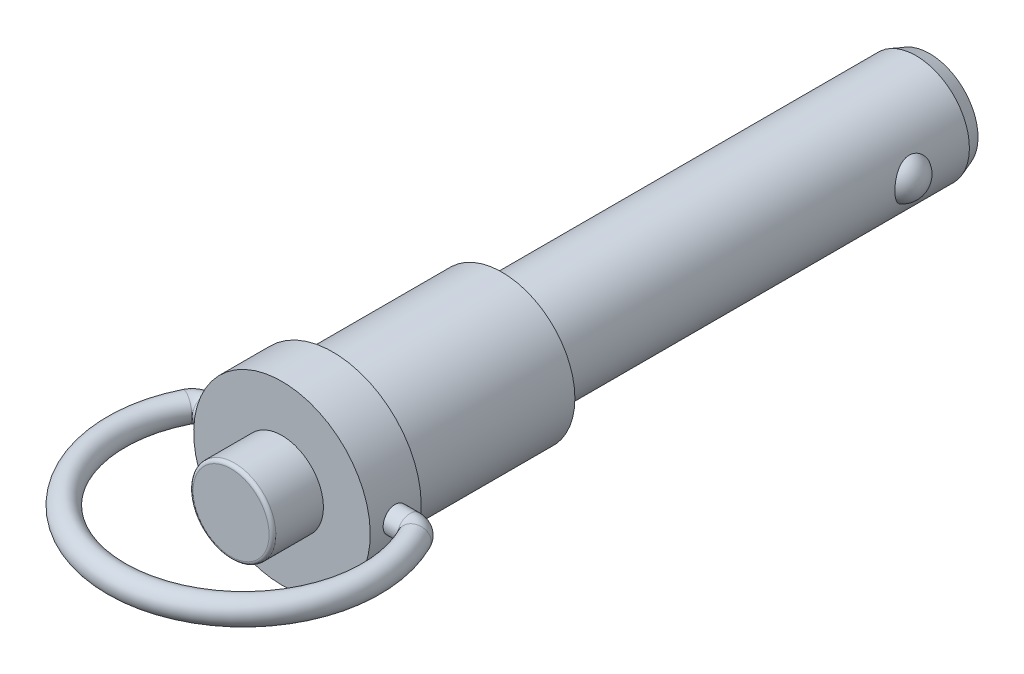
ISO-10303-21;
HEADER;
FILE_DESCRIPTION(('STEP AP214'),'2;1');
FILE_NAME('part.step','',(''),(''),'','','');
FILE_SCHEMA(('AUTOMOTIVE_DESIGN { 1 0 10303 214 1 1 1 1 }'));
ENDSEC;
DATA;
#1=APPLICATION_CONTEXT('core data for automotive mechanical design processes');
#2=APPLICATION_PROTOCOL_DEFINITION('international standard','automotive_design',2000,#1);
#3=PRODUCT_CONTEXT('',#1,'mechanical');
#4=PRODUCT('Part','Part','',(#3));
#5=PRODUCT_RELATED_PRODUCT_CATEGORY('part','',(#4));
#6=PRODUCT_DEFINITION_FORMATION('','',#4);
#7=PRODUCT_DEFINITION_CONTEXT('part definition',#1,'design');
#8=PRODUCT_DEFINITION('design','',#6,#7);
#9=PRODUCT_DEFINITION_SHAPE('','',#8);
#10=(LENGTH_UNIT() NAMED_UNIT(*) SI_UNIT(.MILLI.,.METRE.));
#11=(NAMED_UNIT(*) PLANE_ANGLE_UNIT() SI_UNIT($,.RADIAN.));
#12=(NAMED_UNIT(*) SI_UNIT($,.STERADIAN.) SOLID_ANGLE_UNIT());
#13=UNCERTAINTY_MEASURE_WITH_UNIT(LENGTH_MEASURE(1.E-05),#10,'distance_accuracy_value','');
#14=(GEOMETRIC_REPRESENTATION_CONTEXT(3) GLOBAL_UNCERTAINTY_ASSIGNED_CONTEXT((#13)) GLOBAL_UNIT_ASSIGNED_CONTEXT((#10,
#11,#12)) REPRESENTATION_CONTEXT('',''));
#15=CARTESIAN_POINT('',(0.,0.,0.));
#16=DIRECTION('',(0.,0.,1.));
#17=DIRECTION('',(1.,0.,0.));
#18=AXIS2_PLACEMENT_3D('',#15,#16,#17);
#19=CARTESIAN_POINT('',(-7.23283748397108,0.,-63.9826));
#20=DIRECTION('',(0.,0.,1.));
#21=DIRECTION('',(0.,1.,0.));
#22=AXIS2_PLACEMENT_3D('',#19,#20,#21);
#23=PLANE('',#22);
#24=CARTESIAN_POINT('',(0.,0.,-63.9826));
#25=DIRECTION('',(0.,0.,1.));
#26=DIRECTION('',(0.,1.,0.));
#27=AXIS2_PLACEMENT_3D('',#24,#25,#26);
#28=CIRCLE('',#27,7.23283748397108);
#29=CARTESIAN_POINT('',(0.,7.23283748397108,-63.9826));
#30=VERTEX_POINT('',#29);
#31=EDGE_CURVE('E249',#30,#30,#28,.T.);
#32=ORIENTED_EDGE('',*,*,#31,.F.);
#33=EDGE_LOOP('',(#32));
#34=FACE_BOUND('',#33,.T.);
#35=ADVANCED_FACE('F14',(#34),#23,.F.);
#36=CARTESIAN_POINT('',(6.3254,0.,-53.5178));
#37=DIRECTION('',(0.,0.,1.));
#38=DIRECTION('',(-1.,0.,0.));
#39=AXIS2_PLACEMENT_3D('',#36,#37,#38);
#40=SPHERICAL_SURFACE('',#39,3.175);
#41=CARTESIAN_POINT('',(7.972425,0.,-50.8034062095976));
#42=CARTESIAN_POINT('',(7.97241726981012,0.174963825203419,-50.8034110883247));
#43=CARTESIAN_POINT('',(7.96661031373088,0.3500722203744,-50.8168531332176));
#44=CARTESIAN_POINT('',(7.94391651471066,0.695574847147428,-50.8705412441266));
#45=CARTESIAN_POINT('',(7.92701418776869,0.865962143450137,-50.9108247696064));
#46=CARTESIAN_POINT('',(7.88381094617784,1.19705751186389,-51.0178494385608));
#47=CARTESIAN_POINT('',(7.85750751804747,1.35776298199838,-51.084597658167));
#48=CARTESIAN_POINT('',(7.79828591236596,1.66454963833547,-51.2437588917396));
#49=CARTESIAN_POINT('',(7.76536929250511,1.81063425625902,-51.336165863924));
#50=CARTESIAN_POINT('',(7.6973220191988,2.08082133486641,-51.5434318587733));
#51=CARTESIAN_POINT('',(7.6622476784,2.20529978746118,-51.6578132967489));
#52=CARTESIAN_POINT('',(7.61082801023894,2.37452550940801,-51.8452714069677));
#53=CARTESIAN_POINT('',(7.59387880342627,2.42804053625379,-51.9104406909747));
#54=CARTESIAN_POINT('',(7.56094914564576,2.52871559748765,-52.045725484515));
#55=CARTESIAN_POINT('',(7.54496815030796,2.57587922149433,-52.115838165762));
#56=CARTESIAN_POINT('',(7.51569590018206,2.66002101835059,-52.2550958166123));
#57=CARTESIAN_POINT('',(7.50229271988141,2.69749875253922,-52.3239160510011));
#58=CARTESIAN_POINT('',(7.47725403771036,2.76614659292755,-52.4649044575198));
#59=CARTESIAN_POINT('',(7.46561758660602,2.79732008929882,-52.537070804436));
#60=CARTESIAN_POINT('',(7.44451748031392,2.85299970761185,-52.6841997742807));
#61=CARTESIAN_POINT('',(7.43505273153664,2.87750918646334,-52.7591609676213));
#62=CARTESIAN_POINT('',(7.41863811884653,2.919568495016,-52.9112788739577));
#63=CARTESIAN_POINT('',(7.41168797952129,2.93711908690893,-52.9884353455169));
#64=CARTESIAN_POINT('',(7.40116212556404,2.96353478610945,-53.1359046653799));
#65=CARTESIAN_POINT('',(7.39730521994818,2.97312751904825,-53.2060679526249));
#66=CARTESIAN_POINT('',(7.39192783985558,2.98647205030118,-53.3470623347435));
#67=CARTESIAN_POINT('',(7.3904081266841,2.99022194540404,-53.4178936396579));
#68=CARTESIAN_POINT('',(7.38975833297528,2.99182794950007,-53.5595897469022));
#69=CARTESIAN_POINT('',(7.39062662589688,2.98968807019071,-53.6304544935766));
#70=CARTESIAN_POINT('',(7.39471686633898,2.97955470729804,-53.7717034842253));
#71=CARTESIAN_POINT('',(7.39793967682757,2.97155907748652,-53.8420875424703));
#72=CARTESIAN_POINT('',(7.41052697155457,2.94009947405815,-54.0439191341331));
#73=CARTESIAN_POINT('',(7.42280379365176,2.90920494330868,-54.1741115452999));
#74=CARTESIAN_POINT('',(7.45413145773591,2.82795803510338,-54.4273054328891));
#75=CARTESIAN_POINT('',(7.47318306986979,2.77760344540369,-54.5503060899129));
#76=CARTESIAN_POINT('',(7.51696016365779,2.65690222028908,-54.7909708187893));
#77=CARTESIAN_POINT('',(7.5418730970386,2.58587106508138,-54.9082567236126));
#78=CARTESIAN_POINT('',(7.59450635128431,2.426938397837,-55.1300314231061));
#79=CARTESIAN_POINT('',(7.62222751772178,2.33903179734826,-55.234516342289));
#80=CARTESIAN_POINT('',(7.68069620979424,2.13967899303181,-55.4383986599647));
#81=CARTESIAN_POINT('',(7.71148158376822,2.02679150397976,-55.5363756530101));
#82=CARTESIAN_POINT('',(7.77061509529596,1.78672707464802,-55.7138815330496));
#83=CARTESIAN_POINT('',(7.79896157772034,1.65954056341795,-55.7933979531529));
#84=CARTESIAN_POINT('',(7.85313577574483,1.38188004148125,-55.939506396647));
#85=CARTESIAN_POINT('',(7.87849512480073,1.23034006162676,-56.0042480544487));
#86=CARTESIAN_POINT('',(7.92093083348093,0.918236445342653,-56.1099613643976));
#87=CARTESIAN_POINT('',(7.9380155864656,0.757682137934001,-56.1509571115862));
#88=CARTESIAN_POINT('',(7.95754077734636,0.496793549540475,-56.1973352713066));
#89=CARTESIAN_POINT('',(7.96310427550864,0.397984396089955,-56.2104005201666));
#90=CARTESIAN_POINT('',(7.97054862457,0.199465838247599,-56.2278312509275));
#91=CARTESIAN_POINT('',(7.97242940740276,0.0997564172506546,-56.2321965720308));
#92=CARTESIAN_POINT('',(7.97241726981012,-0.174963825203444,-56.2321889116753));
#93=CARTESIAN_POINT('',(7.96661031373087,-0.350072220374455,-56.2187468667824));
#94=CARTESIAN_POINT('',(7.94391651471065,-0.695574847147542,-56.1650587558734));
#95=CARTESIAN_POINT('',(7.92701418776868,-0.865962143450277,-56.1247752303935));
#96=CARTESIAN_POINT('',(7.88381094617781,-1.19705751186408,-56.0177505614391));
#97=CARTESIAN_POINT('',(7.85750751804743,-1.3577629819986,-55.9510023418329));
#98=CARTESIAN_POINT('',(7.79828591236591,-1.66454963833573,-55.7918411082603));
#99=CARTESIAN_POINT('',(7.76536929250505,-1.8106342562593,-55.6994341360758));
#100=CARTESIAN_POINT('',(7.69732201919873,-2.08082133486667,-55.4921681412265));
#101=CARTESIAN_POINT('',(7.66224767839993,-2.20529978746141,-55.3777867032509));
#102=CARTESIAN_POINT('',(7.61082801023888,-2.37452550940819,-55.190328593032));
#103=CARTESIAN_POINT('',(7.59387880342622,-2.42804053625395,-55.125159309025));
#104=CARTESIAN_POINT('',(7.56094914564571,-2.52871559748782,-54.9898745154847));
#105=CARTESIAN_POINT('',(7.54496815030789,-2.57587922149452,-54.9197618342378));
#106=CARTESIAN_POINT('',(7.51569590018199,-2.66002101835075,-54.7805041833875));
#107=CARTESIAN_POINT('',(7.50229271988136,-2.69749875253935,-54.7116839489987));
#108=CARTESIAN_POINT('',(7.47725403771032,-2.76614659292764,-54.57069554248));
#109=CARTESIAN_POINT('',(7.46561758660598,-2.79732008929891,-54.4985291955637));
#110=CARTESIAN_POINT('',(7.44451748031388,-2.85299970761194,-54.351400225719));
#111=CARTESIAN_POINT('',(7.43505273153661,-2.87750918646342,-54.2764390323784));
#112=CARTESIAN_POINT('',(7.41863811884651,-2.91956849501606,-54.124321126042));
#113=CARTESIAN_POINT('',(7.41168797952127,-2.93711908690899,-54.0471646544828));
#114=CARTESIAN_POINT('',(7.40116212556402,-2.96353478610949,-53.8996953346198));
#115=CARTESIAN_POINT('',(7.39730521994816,-2.97312751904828,-53.8295320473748));
#116=CARTESIAN_POINT('',(7.39192783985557,-2.98647205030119,-53.6885376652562));
#117=CARTESIAN_POINT('',(7.3904081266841,-2.99022194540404,-53.6177063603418));
#118=CARTESIAN_POINT('',(7.38975833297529,-2.99182794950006,-53.4760102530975));
#119=CARTESIAN_POINT('',(7.39062662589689,-2.98968807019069,-53.4051455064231));
#120=CARTESIAN_POINT('',(7.39471686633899,-2.979554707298,-53.2638965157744));
#121=CARTESIAN_POINT('',(7.39793967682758,-2.97155907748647,-53.1935124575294));
#122=CARTESIAN_POINT('',(7.41052697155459,-2.94009947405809,-52.9916808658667));
#123=CARTESIAN_POINT('',(7.42280379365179,-2.90920494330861,-52.8614884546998));
#124=CARTESIAN_POINT('',(7.45413145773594,-2.82795803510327,-52.6082945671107));
#125=CARTESIAN_POINT('',(7.47318306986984,-2.77760344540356,-52.4852939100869));
#126=CARTESIAN_POINT('',(7.51696016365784,-2.65690222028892,-52.2446291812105));
#127=CARTESIAN_POINT('',(7.54187309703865,-2.58587106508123,-52.1273432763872));
#128=CARTESIAN_POINT('',(7.59450635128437,-2.42693839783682,-51.9055685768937));
#129=CARTESIAN_POINT('',(7.62222751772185,-2.33903179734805,-51.8010836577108));
#130=CARTESIAN_POINT('',(7.68069620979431,-2.13967899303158,-51.5972013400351));
#131=CARTESIAN_POINT('',(7.71148158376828,-2.02679150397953,-51.4992243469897));
#132=CARTESIAN_POINT('',(7.77061509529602,-1.78672707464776,-51.3217184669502));
#133=CARTESIAN_POINT('',(7.7989615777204,-1.65954056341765,-51.242202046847));
#134=CARTESIAN_POINT('',(7.85313577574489,-1.38188004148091,-51.0960936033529));
#135=CARTESIAN_POINT('',(7.87849512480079,-1.23034006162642,-51.0313519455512));
#136=CARTESIAN_POINT('',(7.92093083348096,-0.918236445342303,-50.9256386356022));
#137=CARTESIAN_POINT('',(7.93801558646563,-0.757682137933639,-50.8846428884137));
#138=CARTESIAN_POINT('',(7.95754077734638,-0.496793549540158,-50.8382647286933));
#139=CARTESIAN_POINT('',(7.96310427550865,-0.397984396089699,-50.8251994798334));
#140=CARTESIAN_POINT('',(7.97054862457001,-0.199465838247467,-50.8077687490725));
#141=CARTESIAN_POINT('',(7.97242940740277,-0.0997564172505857,-50.8034034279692));
#142=CARTESIAN_POINT('',(7.972425,0.,-50.8034062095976));
#143=B_SPLINE_CURVE_WITH_KNOTS('',3,(#41,#42,#43,#44,#45,#46,#47,#48,#49,#50,#51,#52,#53,#54,
#55,#56,#57,#58,#59,#60,#61,#62,#63,#64,#65,#66,#67,#68,#69,#70,#71,#72,#73,#74,#75,#76,#77,#78,
#79,#80,#81,#82,#83,#84,#85,#86,#87,#88,#89,#90,#91,#92,#93,#94,#95,#96,#97,#98,#99,#100,#101,
#102,#103,#104,#105,#106,#107,#108,#109,#110,#111,#112,#113,#114,#115,#116,#117,#118,#119,#120,
#121,#122,#123,#124,#125,#126,#127,#128,#129,#130,#131,#132,#133,#134,#135,#136,#137,#138,#139,
#140,#141,#142),.UNSPECIFIED.,.T.,.F.,(4,2,2,2,2,2,2,2,2,2,2,2,2,2,2,2,2,2,2,2,2,2,2,2,2,2,2,2,
2,2,2,2,2,2,2,2,2,2,2,2,2,2,2,2,2,2,2,2,2,2,4),(0.,0.524532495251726,1.04979855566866,
1.575205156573,2.10048814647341,2.61543479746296,2.87315909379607,3.13073711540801,
3.3689179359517,3.6069703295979,3.84490258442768,4.08280877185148,4.29529683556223,
4.50785409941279,4.7202666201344,4.93275703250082,5.33386765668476,5.73502389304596,
6.15136290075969,6.56782764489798,7.02375816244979,7.47999569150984,7.97801301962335,
8.47552411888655,8.77458316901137,9.07364774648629,9.59818024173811,10.1234463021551,
10.6488529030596,11.1741358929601,11.6890825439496,11.9468068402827,12.2043848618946,
12.4425656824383,12.6806180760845,12.9185503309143,13.1564565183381,13.3689445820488,
13.5815018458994,13.793914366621,14.0064047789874,14.4075154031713,14.8086716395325,
15.2250106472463,15.6414753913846,16.0974059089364,16.5536434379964,17.05166076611,
17.5491718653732,17.8482309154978,18.1472954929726),.UNSPECIFIED.);
#144=CARTESIAN_POINT('',(7.972425,0.,-50.8034062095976));
#145=VERTEX_POINT('',#144);
#146=EDGE_CURVE('E230',#145,#145,#143,.T.);
#147=ORIENTED_EDGE('',*,*,#146,.F.);
#148=EDGE_LOOP('',(#147));
#149=FACE_BOUND('',#148,.T.);
#150=ADVANCED_FACE('F203',(#149),#40,.T.);
#151=CARTESIAN_POINT('',(-6.3246,0.,-53.5178));
#152=DIRECTION('',(0.,0.,1.));
#153=DIRECTION('',(-1.,0.,0.));
#154=AXIS2_PLACEMENT_3D('',#151,#152,#153);
#155=SPHERICAL_SURFACE('',#154,3.175);
#156=CARTESIAN_POINT('',(-7.972425,0.,-56.2317082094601));
#157=CARTESIAN_POINT('',(-7.97241727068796,0.174952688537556,-56.2317033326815));
#158=CARTESIAN_POINT('',(-7.96661105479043,0.350049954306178,-56.2182623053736));
#159=CARTESIAN_POINT('',(-7.94392013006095,0.69553082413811,-56.1645780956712));
#160=CARTESIAN_POINT('',(-7.92701993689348,0.865907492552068,-56.1242974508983));
#161=CARTESIAN_POINT('',(-7.88382210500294,1.19698257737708,-56.0172798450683));
#162=CARTESIAN_POINT('',(-7.85752194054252,1.35767837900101,-55.950535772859));
#163=CARTESIAN_POINT('',(-7.79830777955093,1.66444625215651,-55.7913834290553));
#164=CARTESIAN_POINT('',(-7.76539534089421,1.81052175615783,-55.6989812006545));
#165=CARTESIAN_POINT('',(-7.69735815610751,2.08068673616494,-55.4917274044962));
#166=CARTESIAN_POINT('',(-7.66228978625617,2.20515274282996,-55.3773541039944));
#167=CARTESIAN_POINT('',(-7.61087967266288,2.37435974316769,-55.1899087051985));
#168=CARTESIAN_POINT('',(-7.593933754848,2.42786851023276,-55.124743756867));
#169=CARTESIAN_POINT('',(-7.5610108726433,2.52853087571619,-54.9894677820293));
#170=CARTESIAN_POINT('',(-7.54503336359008,2.57568806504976,-54.9193595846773));
#171=CARTESIAN_POINT('',(-7.515769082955,2.65981407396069,-54.7801158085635));
#172=CARTESIAN_POINT('',(-7.5023702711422,2.69728292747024,-54.7113052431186));
#173=CARTESIAN_POINT('',(-7.47734019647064,2.7659135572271,-54.5703368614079));
#174=CARTESIAN_POINT('',(-7.46570798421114,2.79707872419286,-54.4981808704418));
#175=CARTESIAN_POINT('',(-7.44461613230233,2.8527421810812,-54.3510733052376));
#176=CARTESIAN_POINT('',(-7.43515539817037,2.87724383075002,-54.2761231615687));
#177=CARTESIAN_POINT('',(-7.41874848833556,2.91928796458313,-54.1240280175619));
#178=CARTESIAN_POINT('',(-7.41180203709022,2.93683121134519,-54.0468832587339));
#179=CARTESIAN_POINT('',(-7.40128307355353,2.96323267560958,-53.8994411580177));
#180=CARTESIAN_POINT('',(-7.39742927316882,2.97281883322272,-53.829293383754));
#181=CARTESIAN_POINT('',(-7.3920573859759,2.98615137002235,-53.6883306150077));
#182=CARTESIAN_POINT('',(-7.39054006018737,2.98989584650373,-53.6175154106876));
#183=CARTESIAN_POINT('',(-7.38989424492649,2.99149222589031,-53.4758519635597));
#184=CARTESIAN_POINT('',(-7.39076412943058,2.98934813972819,-53.4050037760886));
#185=CARTESIAN_POINT('',(-7.39485671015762,2.97920762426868,-53.2637882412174));
#186=CARTESIAN_POINT('',(-7.39808026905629,2.971209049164,-53.1934210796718));
#187=CARTESIAN_POINT('',(-7.41066840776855,2.93974298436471,-52.9916394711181));
#188=CARTESIAN_POINT('',(-7.42294415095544,2.90884676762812,-52.8614803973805));
#189=CARTESIAN_POINT('',(-7.45426659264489,2.82760178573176,-52.6083526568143));
#190=CARTESIAN_POINT('',(-7.4733140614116,2.77725080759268,-52.4853848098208));
#191=CARTESIAN_POINT('',(-7.51708080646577,2.6565607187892,-52.2447817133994));
#192=CARTESIAN_POINT('',(-7.5419875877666,2.5855367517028,-52.1275248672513));
#193=CARTESIAN_POINT('',(-7.59460690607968,2.42662332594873,-51.9058059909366));
#194=CARTESIAN_POINT('',(-7.62232028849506,2.33872877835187,-51.80134783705));
#195=CARTESIAN_POINT('',(-7.68077324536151,2.13940178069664,-51.5975136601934));
#196=CARTESIAN_POINT('',(-7.71155061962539,2.02652778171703,-51.4995584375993));
#197=CARTESIAN_POINT('',(-7.77066832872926,1.78649437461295,-51.3220926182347));
#198=CARTESIAN_POINT('',(-7.79900700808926,1.65932539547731,-51.2425944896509));
#199=CARTESIAN_POINT('',(-7.85316757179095,1.38169777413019,-51.0965158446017));
#200=CARTESIAN_POINT('',(-7.87852090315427,1.23017281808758,-51.0317864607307));
#201=CARTESIAN_POINT('',(-7.92094613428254,0.918101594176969,-50.9260941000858));
#202=CARTESIAN_POINT('',(-7.93802642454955,0.757564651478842,-50.8851070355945));
#203=CARTESIAN_POINT('',(-7.95754577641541,0.496710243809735,-50.8387404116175));
#204=CARTESIAN_POINT('',(-7.96310740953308,0.397917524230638,-50.8256788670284));
#205=CARTESIAN_POINT('',(-7.97054925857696,0.199432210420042,-50.8082530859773));
#206=CARTESIAN_POINT('',(-7.97242940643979,0.0997395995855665,-50.8038890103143));
#207=CARTESIAN_POINT('',(-7.97241727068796,-0.174952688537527,-50.8038966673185));
#208=CARTESIAN_POINT('',(-7.96661105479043,-0.350049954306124,-50.8173376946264));
#209=CARTESIAN_POINT('',(-7.94392013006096,-0.695530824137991,-50.8710219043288));
#210=CARTESIAN_POINT('',(-7.92701993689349,-0.865907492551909,-50.9113025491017));
#211=CARTESIAN_POINT('',(-7.88382210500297,-1.19698257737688,-51.0183201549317));
#212=CARTESIAN_POINT('',(-7.85752194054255,-1.3576783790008,-51.0850642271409));
#213=CARTESIAN_POINT('',(-7.79830777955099,-1.66444625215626,-51.2442165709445));
#214=CARTESIAN_POINT('',(-7.76539534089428,-1.81052175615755,-51.3366187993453));
#215=CARTESIAN_POINT('',(-7.69735815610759,-2.08068673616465,-51.5438725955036));
#216=CARTESIAN_POINT('',(-7.66228978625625,-2.2051527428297,-51.6582458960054));
#217=CARTESIAN_POINT('',(-7.61087967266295,-2.37435974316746,-51.8456912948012));
#218=CARTESIAN_POINT('',(-7.59393375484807,-2.42786851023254,-51.9108562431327));
#219=CARTESIAN_POINT('',(-7.56101087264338,-2.52853087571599,-52.0461322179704));
#220=CARTESIAN_POINT('',(-7.54503336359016,-2.57568806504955,-52.1162404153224));
#221=CARTESIAN_POINT('',(-7.51576908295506,-2.65981407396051,-52.2554841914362));
#222=CARTESIAN_POINT('',(-7.50237027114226,-2.69728292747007,-52.3242947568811));
#223=CARTESIAN_POINT('',(-7.47734019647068,-2.76591355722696,-52.4652631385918));
#224=CARTESIAN_POINT('',(-7.46570798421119,-2.79707872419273,-52.5374191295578));
#225=CARTESIAN_POINT('',(-7.44461613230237,-2.8527421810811,-52.6845266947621));
#226=CARTESIAN_POINT('',(-7.4351553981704,-2.87724383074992,-52.7594768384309));
#227=CARTESIAN_POINT('',(-7.41874848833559,-2.91928796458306,-52.9115719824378));
#228=CARTESIAN_POINT('',(-7.41180203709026,-2.93683121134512,-52.9887167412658));
#229=CARTESIAN_POINT('',(-7.40128307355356,-2.96323267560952,-53.136158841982));
#230=CARTESIAN_POINT('',(-7.39742927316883,-2.97281883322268,-53.2063066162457));
#231=CARTESIAN_POINT('',(-7.3920573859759,-2.98615137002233,-53.347269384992));
#232=CARTESIAN_POINT('',(-7.39054006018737,-2.98989584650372,-53.4180845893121));
#233=CARTESIAN_POINT('',(-7.38989424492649,-2.99149222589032,-53.55974803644));
#234=CARTESIAN_POINT('',(-7.39076412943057,-2.9893481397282,-53.630596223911));
#235=CARTESIAN_POINT('',(-7.39485671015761,-2.97920762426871,-53.7718117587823));
#236=CARTESIAN_POINT('',(-7.39808026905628,-2.97120904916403,-53.8421789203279));
#237=CARTESIAN_POINT('',(-7.41066840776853,-2.93974298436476,-54.0439605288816));
#238=CARTESIAN_POINT('',(-7.42294415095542,-2.90884676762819,-54.1741196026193));
#239=CARTESIAN_POINT('',(-7.45426659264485,-2.82760178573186,-54.4272473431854));
#240=CARTESIAN_POINT('',(-7.47331406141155,-2.77725080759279,-54.550215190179));
#241=CARTESIAN_POINT('',(-7.51708080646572,-2.65656071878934,-54.7908182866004));
#242=CARTESIAN_POINT('',(-7.54198758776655,-2.58553675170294,-54.9080751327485));
#243=CARTESIAN_POINT('',(-7.59460690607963,-2.4266233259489,-55.1297940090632));
#244=CARTESIAN_POINT('',(-7.62232028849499,-2.33872877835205,-55.2342521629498));
#245=CARTESIAN_POINT('',(-7.68077324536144,-2.13940178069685,-55.4380863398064));
#246=CARTESIAN_POINT('',(-7.71155061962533,-2.02652778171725,-55.5360415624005));
#247=CARTESIAN_POINT('',(-7.77066832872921,-1.7864943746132,-55.7135073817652));
#248=CARTESIAN_POINT('',(-7.7990070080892,-1.65932539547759,-55.793005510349));
#249=CARTESIAN_POINT('',(-7.85316757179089,-1.3816977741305,-55.9390841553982));
#250=CARTESIAN_POINT('',(-7.87852090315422,-1.2301728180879,-56.0038135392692));
#251=CARTESIAN_POINT('',(-7.9209461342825,-0.9181015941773,-56.1095058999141));
#252=CARTESIAN_POINT('',(-7.93802642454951,-0.757564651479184,-56.1504929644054));
#253=CARTESIAN_POINT('',(-7.95754577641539,-0.496710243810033,-56.1968595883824));
#254=CARTESIAN_POINT('',(-7.96310740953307,-0.397917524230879,-56.2099211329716));
#255=CARTESIAN_POINT('',(-7.97054925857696,-0.199432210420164,-56.2273469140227));
#256=CARTESIAN_POINT('',(-7.97242940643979,-0.0997395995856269,-56.2317109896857));
#257=CARTESIAN_POINT('',(-7.972425,0.,-56.2317082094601));
#258=B_SPLINE_CURVE_WITH_KNOTS('',3,(#156,#157,#158,#159,#160,#161,#162,#163,#164,#165,#166,
#167,#168,#169,#170,#171,#172,#173,#174,#175,#176,#177,#178,#179,#180,#181,#182,#183,#184,#185,
#186,#187,#188,#189,#190,#191,#192,#193,#194,#195,#196,#197,#198,#199,#200,#201,#202,#203,#204,
#205,#206,#207,#208,#209,#210,#211,#212,#213,#214,#215,#216,#217,#218,#219,#220,#221,#222,#223,
#224,#225,#226,#227,#228,#229,#230,#231,#232,#233,#234,#235,#236,#237,#238,#239,#240,#241,#242,
#243,#244,#245,#246,#247,#248,#249,#250,#251,#252,#253,#254,#255,#256,#257),.UNSPECIFIED.,.T.,
.F.,(4,2,2,2,2,2,2,2,2,2,2,2,2,2,2,2,2,2,2,2,2,2,2,2,2,2,2,2,2,2,2,2,2,2,2,2,2,2,2,2,2,2,2,2,2,
2,2,2,2,2,4),(0.,0.524499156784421,1.04973194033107,1.57510595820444,2.10035634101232,
2.61525617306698,2.87295695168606,3.130511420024,3.36865238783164,3.60666491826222,
3.84455721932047,4.08242344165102,4.29486234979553,4.50737043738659,4.71973381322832,
4.93217506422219,5.33319020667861,5.7342509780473,6.15050279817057,6.56688037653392,
7.02273464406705,7.47889596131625,7.97685568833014,8.47430932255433,8.773317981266,
9.07233216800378,9.59683132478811,10.1220641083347,10.6474381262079,11.1726885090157,
11.6875883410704,11.9452891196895,12.2028435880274,12.4409845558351,12.6789970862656,
12.9168893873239,13.1547556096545,13.367194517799,13.57970260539,13.7920659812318,
14.0045072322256,14.4055223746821,14.8065831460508,15.2228349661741,15.6392125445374,
16.0950668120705,16.5512281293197,17.0491878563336,17.5466414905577,17.8456501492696,
18.1446643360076),.UNSPECIFIED.);
#259=CARTESIAN_POINT('',(-7.972425,0.,-56.2317082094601));
#260=VERTEX_POINT('',#259);
#261=EDGE_CURVE('E25',#260,#260,#258,.T.);
#262=ORIENTED_EDGE('',*,*,#261,.F.);
#263=EDGE_LOOP('',(#262));
#264=FACE_BOUND('',#263,.T.);
#265=ADVANCED_FACE('F209',(#264),#155,.T.);
#266=CARTESIAN_POINT('',(0.,0.,-61.9506));
#267=DIRECTION('',(0.,0.,1.));
#268=DIRECTION('',(0.,1.,0.));
#269=AXIS2_PLACEMENT_3D('',#266,#267,#268);
#270=CONICAL_SURFACE('',#269,7.972425,0.349065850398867);
#271=CARTESIAN_POINT('',(0.,0.,-61.9506));
#272=DIRECTION('',(0.,0.,1.));
#273=DIRECTION('',(0.,1.,0.));
#274=AXIS2_PLACEMENT_3D('',#271,#272,#273);
#275=CIRCLE('',#274,7.972425);
#276=CARTESIAN_POINT('',(0.,7.972425,-61.9506));
#277=VERTEX_POINT('',#276);
#278=EDGE_CURVE('E9',#277,#277,#275,.T.);
#279=ORIENTED_EDGE('',*,*,#278,.F.);
#280=EDGE_LOOP('',(#279));
#281=FACE_BOUND('',#280,.T.);
#282=ORIENTED_EDGE('',*,*,#31,.T.);
#283=EDGE_LOOP('',(#282));
#284=FACE_BOUND('',#283,.T.);
#285=ADVANCED_FACE('F237',(#281,#284),#270,.T.);
#286=CARTESIAN_POINT('',(0.,0.,0.));
#287=DIRECTION('',(0.,0.,1.));
#288=DIRECTION('',(0.,1.,0.));
#289=AXIS2_PLACEMENT_3D('',#286,#287,#288);
#290=CYLINDRICAL_SURFACE('',#289,7.972425);
#291=CARTESIAN_POINT('',(0.,0.,0.));
#292=DIRECTION('',(0.,0.,-1.));
#293=DIRECTION('',(0.,1.,0.));
#294=AXIS2_PLACEMENT_3D('',#291,#292,#293);
#295=CIRCLE('',#294,7.972425);
#296=CARTESIAN_POINT('',(0.,7.97242499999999,0.));
#297=VERTEX_POINT('',#296);
#298=EDGE_CURVE('E222',#297,#297,#295,.F.);
#299=ORIENTED_EDGE('',*,*,#298,.F.);
#300=EDGE_LOOP('',(#299));
#301=FACE_BOUND('',#300,.T.);
#302=ORIENTED_EDGE('',*,*,#278,.T.);
#303=EDGE_LOOP('',(#302));
#304=FACE_BOUND('',#303,.T.);
#305=ORIENTED_EDGE('',*,*,#261,.T.);
#306=EDGE_LOOP('',(#305));
#307=FACE_BOUND('',#306,.T.);
#308=ORIENTED_EDGE('',*,*,#146,.T.);
#309=EDGE_LOOP('',(#308));
#310=FACE_BOUND('',#309,.T.);
#311=ADVANCED_FACE('F63',(#301,#304,#307,#310),#290,.T.);
#312=CARTESIAN_POINT('',(0.,0.,40.545));
#313=DIRECTION('',(0.,0.,1.));
#314=DIRECTION('',(0.,1.,0.));
#315=AXIS2_PLACEMENT_3D('',#312,#313,#314);
#316=PLANE('',#315);
#317=CARTESIAN_POINT('',(0.,0.,40.545));
#318=DIRECTION('',(0.,0.,-1.));
#319=DIRECTION('',(0.,-1.,0.));
#320=AXIS2_PLACEMENT_3D('',#317,#318,#319);
#321=CIRCLE('',#320,5.6896);
#322=CARTESIAN_POINT('',(0.,-5.6896,40.545));
#323=VERTEX_POINT('',#322);
#324=CARTESIAN_POINT('',(0.,5.6896,40.545));
#325=VERTEX_POINT('',#324);
#326=EDGE_CURVE('E38',#323,#325,#321,.T.);
#327=ORIENTED_EDGE('',*,*,#326,.F.);
#328=CARTESIAN_POINT('',(0.,0.,40.545));
#329=DIRECTION('',(0.,0.,-1.));
#330=DIRECTION('',(0.,1.,0.));
#331=AXIS2_PLACEMENT_3D('',#328,#329,#330);
#332=CIRCLE('',#331,5.6896);
#333=EDGE_CURVE('E32',#325,#323,#332,.T.);
#334=ORIENTED_EDGE('',*,*,#333,.F.);
#335=EDGE_LOOP('',(#327,#334));
#336=FACE_BOUND('',#335,.T.);
#337=ADVANCED_FACE('F43',(#336),#316,.T.);
#338=CARTESIAN_POINT('',(0.,0.,38.64));
#339=DIRECTION('',(0.,1.,0.));
#340=DIRECTION('',(-1.,0.,0.));
#341=AXIS2_PLACEMENT_3D('',#338,#339,#340);
#342=TOROIDAL_SURFACE('',#341,19.05,1.8796);
#343=CARTESIAN_POINT('',(-17.0651122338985,0.,30.1733333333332));
#344=DIRECTION('',(-0.44444444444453,0.,0.895806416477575));
#345=DIRECTION('',(-0.895806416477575,0.,-0.44444444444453));
#346=AXIS2_PLACEMENT_3D('',#343,#344,#345);
#347=CIRCLE('',#346,1.8796);
#348=CARTESIAN_POINT('',(-18.7488699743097,0.,29.3379555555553));
#349=VERTEX_POINT('',#348);
#350=EDGE_CURVE('E107',#349,#349,#347,.F.);
#351=ORIENTED_EDGE('',*,*,#350,.F.);
#352=EDGE_LOOP('',(#351));
#353=FACE_BOUND('',#352,.T.);
#354=CARTESIAN_POINT('',(17.0651122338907,0.,30.1733333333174));
#355=DIRECTION('',(-0.444444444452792,0.,-0.895806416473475));
#356=DIRECTION('',(0.895806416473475,0.,-0.444444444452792));
#357=AXIS2_PLACEMENT_3D('',#354,#355,#356);
#358=CIRCLE('',#357,1.8796);
#359=CARTESIAN_POINT('',(18.7488699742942,0.,29.3379555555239));
#360=VERTEX_POINT('',#359);
#361=EDGE_CURVE('E104',#360,#360,#358,.T.);
#362=ORIENTED_EDGE('',*,*,#361,.F.);
#363=EDGE_LOOP('',(#362));
#364=FACE_BOUND('',#363,.T.);
#365=ADVANCED_FACE('F62',(#353,#364),#342,.T.);
#366=CARTESIAN_POINT('',(0.,0.,40.037));
#367=DIRECTION('',(0.,0.,1.));
#368=DIRECTION('',(0.,1.,0.));
#369=AXIS2_PLACEMENT_3D('',#366,#367,#368);
#370=TOROIDAL_SURFACE('',#369,5.6896,0.508);
#371=ORIENTED_EDGE('',*,*,#333,.T.);
#372=ORIENTED_EDGE('',*,*,#326,.T.);
#373=EDGE_LOOP('',(#371,#372));
#374=FACE_BOUND('',#373,.T.);
#375=CARTESIAN_POINT('',(0.,0.,40.037));
#376=DIRECTION('',(0.,0.,-1.));
#377=DIRECTION('',(0.,-1.,0.));
#378=AXIS2_PLACEMENT_3D('',#375,#376,#377);
#379=CIRCLE('',#378,6.1976);
#380=CARTESIAN_POINT('',(0.,-6.1976,40.037));
#381=VERTEX_POINT('',#380);
#382=EDGE_CURVE('E81',#381,#381,#379,.T.);
#383=ORIENTED_EDGE('',*,*,#382,.F.);
#384=EDGE_LOOP('',(#383));
#385=FACE_BOUND('',#384,.T.);
#386=ADVANCED_FACE('F36',(#374,#385),#370,.T.);
#387=CARTESIAN_POINT('',(-15.3586010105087,0.,31.02));
#388=DIRECTION('',(0.,1.,0.));
#389=DIRECTION('',(-1.,0.,0.));
#390=AXIS2_PLACEMENT_3D('',#387,#388,#389);
#391=TOROIDAL_SURFACE('',#390,1.905,1.8796);
#392=CARTESIAN_POINT('',(-15.3586010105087,0.,29.115));
#393=DIRECTION('',(1.,0.,0.));
#394=DIRECTION('',(0.,0.,-1.));
#395=AXIS2_PLACEMENT_3D('',#392,#393,#394);
#396=CIRCLE('',#395,1.8796);
#397=CARTESIAN_POINT('',(-15.3586010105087,0.,27.2354));
#398=VERTEX_POINT('',#397);
#399=EDGE_CURVE('E40',#398,#398,#396,.T.);
#400=ORIENTED_EDGE('',*,*,#399,.F.);
#401=EDGE_LOOP('',(#400));
#402=FACE_BOUND('',#401,.T.);
#403=ORIENTED_EDGE('',*,*,#350,.T.);
#404=EDGE_LOOP('',(#403));
#405=FACE_BOUND('',#404,.T.);
#406=ADVANCED_FACE('F64',(#402,#405),#391,.T.);
#407=CARTESIAN_POINT('',(15.3586010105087,0.,31.02));
#408=DIRECTION('',(0.,1.,0.));
#409=DIRECTION('',(-1.,0.,0.));
#410=AXIS2_PLACEMENT_3D('',#407,#408,#409);
#411=TOROIDAL_SURFACE('',#410,1.90500000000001,1.8796);
#412=CARTESIAN_POINT('',(15.3586010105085,0.,29.115));
#413=DIRECTION('',(1.,0.,0.));
#414=DIRECTION('',(0.,0.,-1.));
#415=AXIS2_PLACEMENT_3D('',#412,#413,#414);
#416=CIRCLE('',#415,1.8796);
#417=CARTESIAN_POINT('',(15.3586010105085,0.,27.2354));
#418=VERTEX_POINT('',#417);
#419=EDGE_CURVE('E44',#418,#418,#416,.F.);
#420=ORIENTED_EDGE('',*,*,#419,.F.);
#421=EDGE_LOOP('',(#420));
#422=FACE_BOUND('',#421,.T.);
#423=ORIENTED_EDGE('',*,*,#361,.T.);
#424=EDGE_LOOP('',(#423));
#425=FACE_BOUND('',#424,.T.);
#426=ADVANCED_FACE('F66',(#422,#425),#411,.T.);
#427=CARTESIAN_POINT('',(0.,0.,40.545));
#428=DIRECTION('',(0.,0.,-1.));
#429=DIRECTION('',(0.,-1.,0.));
#430=AXIS2_PLACEMENT_3D('',#427,#428,#429);
#431=CYLINDRICAL_SURFACE('',#430,6.1976);
#432=CARTESIAN_POINT('',(0.,0.,32.925));
#433=DIRECTION('',(0.,0.,-1.));
#434=DIRECTION('',(0.,-1.,0.));
#435=AXIS2_PLACEMENT_3D('',#432,#433,#434);
#436=CIRCLE('',#435,6.1976);
#437=CARTESIAN_POINT('',(0.,-6.1976,32.925));
#438=VERTEX_POINT('',#437);
#439=EDGE_CURVE('E117',#438,#438,#436,.T.);
#440=ORIENTED_EDGE('',*,*,#439,.F.);
#441=EDGE_LOOP('',(#440));
#442=FACE_BOUND('',#441,.T.);
#443=ORIENTED_EDGE('',*,*,#382,.T.);
#444=EDGE_LOOP('',(#443));
#445=FACE_BOUND('',#444,.T.);
#446=ADVANCED_FACE('F86',(#442,#445),#431,.T.);
#447=CARTESIAN_POINT('',(-15.3586010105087,0.,29.115));
#448=DIRECTION('',(1.,0.,0.));
#449=DIRECTION('',(0.,0.,-1.));
#450=AXIS2_PLACEMENT_3D('',#447,#448,#449);
#451=CYLINDRICAL_SURFACE('',#450,1.8796);
#452=CARTESIAN_POINT('',(-13.208,0.,27.2354));
#453=CARTESIAN_POINT('',(-13.2079983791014,0.105008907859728,27.235404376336));
#454=CARTESIAN_POINT('',(-13.2067345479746,0.210080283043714,27.2442296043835));
#455=CARTESIAN_POINT('',(-13.2018144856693,0.41729041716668,27.2792908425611));
#456=CARTESIAN_POINT('',(-13.1981558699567,0.519426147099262,27.3055442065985));
#457=CARTESIAN_POINT('',(-13.1888577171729,0.7177359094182,27.3746649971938));
#458=CARTESIAN_POINT('',(-13.1832196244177,0.813914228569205,27.4175203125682));
#459=CARTESIAN_POINT('',(-13.1705868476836,0.99769843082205,27.5185998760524));
#460=CARTESIAN_POINT('',(-13.1635923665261,1.08530559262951,27.5768218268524));
#461=CARTESIAN_POINT('',(-13.1489704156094,1.25009506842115,27.7074204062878));
#462=CARTESIAN_POINT('',(-13.1413392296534,1.32720810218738,27.7798840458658));
#463=CARTESIAN_POINT('',(-13.1263333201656,1.46822296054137,27.9367218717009));
#464=CARTESIAN_POINT('',(-13.1189586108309,1.5321240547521,28.0210967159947));
#465=CARTESIAN_POINT('',(-13.1052644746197,1.6451672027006,28.1998226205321));
#466=CARTESIAN_POINT('',(-13.0989498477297,1.69424288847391,28.2942160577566));
#467=CARTESIAN_POINT('',(-13.088141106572,1.77581811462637,28.490010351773));
#468=CARTESIAN_POINT('',(-13.0836469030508,1.80831846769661,28.5914108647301));
#469=CARTESIAN_POINT('',(-13.0770241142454,1.85560673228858,28.7976151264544));
#470=CARTESIAN_POINT('',(-13.0748797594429,1.87051276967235,28.9023912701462));
#471=CARTESIAN_POINT('',(-13.0731514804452,1.88255508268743,29.1129780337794));
#472=CARTESIAN_POINT('',(-13.0735674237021,1.87969227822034,29.2187885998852));
#473=CARTESIAN_POINT('',(-13.0768983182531,1.85637484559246,29.4276098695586));
#474=CARTESIAN_POINT('',(-13.07979464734,1.8360513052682,29.5306355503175));
#475=CARTESIAN_POINT('',(-13.0877308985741,1.77859429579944,29.7317993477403));
#476=CARTESIAN_POINT('',(-13.0927708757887,1.74146039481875,29.8299373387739));
#477=CARTESIAN_POINT('',(-13.1044472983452,1.65129893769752,30.0189415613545));
#478=CARTESIAN_POINT('',(-13.1110893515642,1.59821538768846,30.1097807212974));
#479=CARTESIAN_POINT('',(-13.1252173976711,1.47770141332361,30.281311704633));
#480=CARTESIAN_POINT('',(-13.1327034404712,1.4102701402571,30.3620029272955));
#481=CARTESIAN_POINT('',(-13.1477584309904,1.26225301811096,30.5117076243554));
#482=CARTESIAN_POINT('',(-13.1553275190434,1.18155436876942,30.5806096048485));
#483=CARTESIAN_POINT('',(-13.1696331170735,1.00967896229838,30.7039085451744));
#484=CARTESIAN_POINT('',(-13.1763696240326,0.918502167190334,30.7583054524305));
#485=CARTESIAN_POINT('',(-13.1882570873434,0.728165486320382,30.8510539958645));
#486=CARTESIAN_POINT('',(-13.1934072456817,0.62900161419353,30.8893975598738));
#487=CARTESIAN_POINT('',(-13.2015349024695,0.425552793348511,30.9488568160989));
#488=CARTESIAN_POINT('',(-13.2045125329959,0.321268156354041,30.969973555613));
#489=CARTESIAN_POINT('',(-13.2079422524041,0.111500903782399,30.9942327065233));
#490=CARTESIAN_POINT('',(-13.2084158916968,0.00603636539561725,30.9975284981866));
#491=CARTESIAN_POINT('',(-13.2068427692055,-0.203940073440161,30.9864585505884));
#492=CARTESIAN_POINT('',(-13.2047960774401,-0.308452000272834,30.9720933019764));
#493=CARTESIAN_POINT('',(-13.1984256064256,-0.513095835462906,30.9262365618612));
#494=CARTESIAN_POINT('',(-13.1941116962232,-0.613244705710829,30.894819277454));
#495=CARTESIAN_POINT('',(-13.1836891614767,-0.806853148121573,30.8158281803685));
#496=CARTESIAN_POINT('',(-13.1775804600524,-0.900312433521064,30.768253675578));
#497=CARTESIAN_POINT('',(-13.1641942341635,-1.07856665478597,30.6579350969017));
#498=CARTESIAN_POINT('',(-13.1569092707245,-1.16330041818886,30.5950930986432));
#499=CARTESIAN_POINT('',(-13.1420059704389,-1.32107337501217,30.4561604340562));
#500=CARTESIAN_POINT('',(-13.1343876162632,-1.39411195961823,30.3800690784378));
#501=CARTESIAN_POINT('',(-13.1196084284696,-1.52697484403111,30.2161171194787));
#502=CARTESIAN_POINT('',(-13.1124514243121,-1.58669669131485,30.1281730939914));
#503=CARTESIAN_POINT('',(-13.099471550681,-1.69052011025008,29.9434117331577));
#504=CARTESIAN_POINT('',(-13.0936486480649,-1.73462206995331,29.8465946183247));
#505=CARTESIAN_POINT('',(-13.0840235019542,-1.80579270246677,29.6471490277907));
#506=CARTESIAN_POINT('',(-13.0802147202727,-1.83291654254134,29.5445405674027));
#507=CARTESIAN_POINT('',(-13.0750312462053,-1.86953730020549,29.336166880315));
#508=CARTESIAN_POINT('',(-13.0736564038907,-1.87903530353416,29.2304018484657));
#509=CARTESIAN_POINT('',(-13.0735016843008,-1.88011086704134,29.0197377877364));
#510=CARTESIAN_POINT('',(-13.0746984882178,-1.87184946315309,28.9148395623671));
#511=CARTESIAN_POINT('',(-13.0795017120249,-1.83798448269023,28.7079399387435));
#512=CARTESIAN_POINT('',(-13.0831081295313,-1.81238092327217,28.6059385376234));
#513=CARTESIAN_POINT('',(-13.092316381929,-1.74461326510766,28.4077650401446));
#514=CARTESIAN_POINT('',(-13.0979169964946,-1.70245929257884,28.3115894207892));
#515=CARTESIAN_POINT('',(-13.1104842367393,-1.60280330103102,28.1276498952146));
#516=CARTESIAN_POINT('',(-13.1174508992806,-1.54530086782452,28.0398862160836));
#517=CARTESIAN_POINT('',(-13.1320406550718,-1.41599095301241,27.8744419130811));
#518=CARTESIAN_POINT('',(-13.1396689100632,-1.34406391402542,27.7968551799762));
#519=CARTESIAN_POINT('',(-13.1546784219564,-1.18819878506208,27.6547945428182));
#520=CARTESIAN_POINT('',(-13.1620596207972,-1.10425789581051,27.590323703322));
#521=CARTESIAN_POINT('',(-13.1757845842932,-0.926263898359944,27.4760444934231));
#522=CARTESIAN_POINT('',(-13.1821230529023,-0.832162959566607,27.4263100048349));
#523=CARTESIAN_POINT('',(-13.1929960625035,-0.636900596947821,27.3434245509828));
#524=CARTESIAN_POINT('',(-13.1975325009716,-0.535746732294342,27.3102561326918));
#525=CARTESIAN_POINT('',(-13.2032356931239,-0.361762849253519,27.2691055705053));
#526=CARTESIAN_POINT('',(-13.205013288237,-0.29001488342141,27.2564849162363));
#527=CARTESIAN_POINT('',(-13.2073959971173,-0.145521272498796,27.2396306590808));
#528=CARTESIAN_POINT('',(-13.2080011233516,-0.0727756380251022,27.2353969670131));
#529=CARTESIAN_POINT('',(-13.208,0.,27.2354));
#530=B_SPLINE_CURVE_WITH_KNOTS('',3,(#452,#453,#454,#455,#456,#457,#458,#459,#460,#461,#462,
#463,#464,#465,#466,#467,#468,#469,#470,#471,#472,#473,#474,#475,#476,#477,#478,#479,#480,#481,
#482,#483,#484,#485,#486,#487,#488,#489,#490,#491,#492,#493,#494,#495,#496,#497,#498,#499,#500,
#501,#502,#503,#504,#505,#506,#507,#508,#509,#510,#511,#512,#513,#514,#515,#516,#517,#518,#519,
#520,#521,#522,#523,#524,#525,#526,#527,#528,#529),.UNSPECIFIED.,.T.,.F.,(4,2,2,2,2,2,2,2,2,2,2,
2,2,2,2,2,2,2,2,2,2,2,2,2,2,2,2,2,2,2,2,2,2,2,2,2,2,2,4),(0.,0.314760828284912,
0.629835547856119,0.944680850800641,1.25947911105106,1.57626405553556,1.89306650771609,
2.21126684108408,2.52945157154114,2.84548767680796,3.16150742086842,3.4751751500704,
3.78885093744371,4.10364106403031,4.41844981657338,4.736088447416,5.05372822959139,
5.37152754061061,5.68930752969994,6.00434806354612,6.3193798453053,6.63305153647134,
6.94673666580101,7.26248947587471,7.57825871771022,7.89637938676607,8.21449215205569,
8.53156582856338,8.84861997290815,9.16281131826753,9.4770023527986,9.79100145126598,
10.1050090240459,10.42173562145,10.7385361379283,11.0568990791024,11.3749259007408,
11.5930708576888,11.8112134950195),.UNSPECIFIED.);
#531=CARTESIAN_POINT('',(-13.208,0.,27.2354));
#532=VERTEX_POINT('',#531);
#533=EDGE_CURVE('E186',#532,#532,#530,.T.);
#534=ORIENTED_EDGE('',*,*,#533,.F.);
#535=EDGE_LOOP('',(#534));
#536=FACE_BOUND('',#535,.T.);
#537=ORIENTED_EDGE('',*,*,#399,.T.);
#538=EDGE_LOOP('',(#537));
#539=FACE_BOUND('',#538,.T.);
#540=ADVANCED_FACE('F87',(#536,#539),#451,.T.);
#541=CARTESIAN_POINT('',(-15.3586010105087,0.,29.115));
#542=DIRECTION('',(1.,0.,0.));
#543=DIRECTION('',(0.,0.,-1.));
#544=AXIS2_PLACEMENT_3D('',#541,#542,#543);
#545=CYLINDRICAL_SURFACE('',#544,1.8796);
#546=CARTESIAN_POINT('',(13.208,0.,27.2354));
#547=CARTESIAN_POINT('',(13.2079983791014,-0.105008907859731,27.235404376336));
#548=CARTESIAN_POINT('',(13.2067345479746,-0.210080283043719,27.2442296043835));
#549=CARTESIAN_POINT('',(13.2018144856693,-0.417290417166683,27.2792908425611));
#550=CARTESIAN_POINT('',(13.1981558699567,-0.51942614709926,27.3055442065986));
#551=CARTESIAN_POINT('',(13.1888577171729,-0.717735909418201,27.3746649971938));
#552=CARTESIAN_POINT('',(13.1832196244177,-0.813914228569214,27.4175203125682));
#553=CARTESIAN_POINT('',(13.1705868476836,-0.997698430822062,27.5185998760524));
#554=CARTESIAN_POINT('',(13.1635923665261,-1.08530559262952,27.5768218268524));
#555=CARTESIAN_POINT('',(13.1489704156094,-1.25009506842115,27.7074204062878));
#556=CARTESIAN_POINT('',(13.1413392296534,-1.32720810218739,27.7798840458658));
#557=CARTESIAN_POINT('',(13.1263333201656,-1.46822296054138,27.9367218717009));
#558=CARTESIAN_POINT('',(13.1189586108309,-1.5321240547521,28.0210967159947));
#559=CARTESIAN_POINT('',(13.1052644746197,-1.6451672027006,28.1998226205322));
#560=CARTESIAN_POINT('',(13.0989498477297,-1.69424288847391,28.2942160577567));
#561=CARTESIAN_POINT('',(13.088141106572,-1.77581811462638,28.490010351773));
#562=CARTESIAN_POINT('',(13.0836469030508,-1.80831846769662,28.5914108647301));
#563=CARTESIAN_POINT('',(13.0770241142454,-1.85560673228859,28.7976151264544));
#564=CARTESIAN_POINT('',(13.0748797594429,-1.87051276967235,28.9023912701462));
#565=CARTESIAN_POINT('',(13.0731514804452,-1.88255508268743,29.1129780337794));
#566=CARTESIAN_POINT('',(13.0735674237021,-1.87969227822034,29.2187885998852));
#567=CARTESIAN_POINT('',(13.0768983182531,-1.85637484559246,29.4276098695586));
#568=CARTESIAN_POINT('',(13.07979464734,-1.8360513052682,29.5306355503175));
#569=CARTESIAN_POINT('',(13.0877308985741,-1.77859429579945,29.7317993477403));
#570=CARTESIAN_POINT('',(13.0927708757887,-1.74146039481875,29.8299373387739));
#571=CARTESIAN_POINT('',(13.1044472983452,-1.65129893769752,30.0189415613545));
#572=CARTESIAN_POINT('',(13.1110893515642,-1.59821538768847,30.1097807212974));
#573=CARTESIAN_POINT('',(13.1252173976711,-1.47770141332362,30.281311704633));
#574=CARTESIAN_POINT('',(13.1327034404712,-1.4102701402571,30.3620029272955));
#575=CARTESIAN_POINT('',(13.1477584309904,-1.26225301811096,30.5117076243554));
#576=CARTESIAN_POINT('',(13.1553275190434,-1.18155436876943,30.5806096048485));
#577=CARTESIAN_POINT('',(13.1696331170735,-1.00967896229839,30.7039085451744));
#578=CARTESIAN_POINT('',(13.1763696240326,-0.918502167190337,30.7583054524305));
#579=CARTESIAN_POINT('',(13.1882570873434,-0.728165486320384,30.8510539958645));
#580=CARTESIAN_POINT('',(13.1934072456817,-0.629001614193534,30.8893975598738));
#581=CARTESIAN_POINT('',(13.2015349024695,-0.425552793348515,30.9488568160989));
#582=CARTESIAN_POINT('',(13.2045125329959,-0.321268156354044,30.969973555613));
#583=CARTESIAN_POINT('',(13.2079422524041,-0.111500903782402,30.9942327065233));
#584=CARTESIAN_POINT('',(13.2084158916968,-0.0060363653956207,30.9975284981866));
#585=CARTESIAN_POINT('',(13.2068427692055,0.203940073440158,30.9864585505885));
#586=CARTESIAN_POINT('',(13.2047960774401,0.308452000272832,30.9720933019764));
#587=CARTESIAN_POINT('',(13.1984256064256,0.513095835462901,30.9262365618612));
#588=CARTESIAN_POINT('',(13.1941116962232,0.613244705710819,30.894819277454));
#589=CARTESIAN_POINT('',(13.1836891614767,0.806853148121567,30.8158281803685));
#590=CARTESIAN_POINT('',(13.1775804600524,0.900312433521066,30.7682536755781));
#591=CARTESIAN_POINT('',(13.1641942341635,1.07856665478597,30.6579350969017));
#592=CARTESIAN_POINT('',(13.1569092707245,1.16330041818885,30.5950930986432));
#593=CARTESIAN_POINT('',(13.1420059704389,1.32107337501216,30.4561604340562));
#594=CARTESIAN_POINT('',(13.1343876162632,1.39411195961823,30.3800690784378));
#595=CARTESIAN_POINT('',(13.1196084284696,1.52697484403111,30.2161171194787));
#596=CARTESIAN_POINT('',(13.1124514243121,1.58669669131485,30.1281730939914));
#597=CARTESIAN_POINT('',(13.099471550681,1.69052011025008,29.9434117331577));
#598=CARTESIAN_POINT('',(13.0936486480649,1.73462206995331,29.8465946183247));
#599=CARTESIAN_POINT('',(13.0840235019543,1.80579270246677,29.6471490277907));
#600=CARTESIAN_POINT('',(13.0802147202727,1.83291654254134,29.5445405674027));
#601=CARTESIAN_POINT('',(13.0750312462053,1.86953730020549,29.336166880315));
#602=CARTESIAN_POINT('',(13.0736564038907,1.87903530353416,29.2304018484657));
#603=CARTESIAN_POINT('',(13.0735016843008,1.88011086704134,29.0197377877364));
#604=CARTESIAN_POINT('',(13.0746984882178,1.87184946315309,28.9148395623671));
#605=CARTESIAN_POINT('',(13.0795017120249,1.83798448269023,28.7079399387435));
#606=CARTESIAN_POINT('',(13.0831081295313,1.81238092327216,28.6059385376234));
#607=CARTESIAN_POINT('',(13.092316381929,1.74461326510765,28.4077650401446));
#608=CARTESIAN_POINT('',(13.0979169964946,1.70245929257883,28.3115894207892));
#609=CARTESIAN_POINT('',(13.1104842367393,1.60280330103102,28.1276498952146));
#610=CARTESIAN_POINT('',(13.1174508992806,1.54530086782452,28.0398862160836));
#611=CARTESIAN_POINT('',(13.1320406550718,1.4159909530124,27.8744419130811));
#612=CARTESIAN_POINT('',(13.1396689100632,1.34406391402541,27.7968551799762));
#613=CARTESIAN_POINT('',(13.1546784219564,1.18819878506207,27.6547945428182));
#614=CARTESIAN_POINT('',(13.1620596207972,1.10425789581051,27.590323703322));
#615=CARTESIAN_POINT('',(13.1757845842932,0.926263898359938,27.4760444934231));
#616=CARTESIAN_POINT('',(13.1821230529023,0.832162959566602,27.4263100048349));
#617=CARTESIAN_POINT('',(13.1929960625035,0.636900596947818,27.3434245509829));
#618=CARTESIAN_POINT('',(13.1975325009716,0.535746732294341,27.3102561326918));
#619=CARTESIAN_POINT('',(13.2032356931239,0.361762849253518,27.2691055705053));
#620=CARTESIAN_POINT('',(13.205013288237,0.290014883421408,27.2564849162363));
#621=CARTESIAN_POINT('',(13.2073959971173,0.145521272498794,27.2396306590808));
#622=CARTESIAN_POINT('',(13.2080011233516,0.0727756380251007,27.2353969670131));
#623=CARTESIAN_POINT('',(13.208,0.,27.2354));
#624=B_SPLINE_CURVE_WITH_KNOTS('',3,(#546,#547,#548,#549,#550,#551,#552,#553,#554,#555,#556,
#557,#558,#559,#560,#561,#562,#563,#564,#565,#566,#567,#568,#569,#570,#571,#572,#573,#574,#575,
#576,#577,#578,#579,#580,#581,#582,#583,#584,#585,#586,#587,#588,#589,#590,#591,#592,#593,#594,
#595,#596,#597,#598,#599,#600,#601,#602,#603,#604,#605,#606,#607,#608,#609,#610,#611,#612,#613,
#614,#615,#616,#617,#618,#619,#620,#621,#622,#623),.UNSPECIFIED.,.T.,.F.,(4,2,2,2,2,2,2,2,2,2,2,
2,2,2,2,2,2,2,2,2,2,2,2,2,2,2,2,2,2,2,2,2,2,2,2,2,2,2,4),(0.,0.314760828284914,
0.629835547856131,0.944680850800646,1.25947911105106,1.57626405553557,1.89306650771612,
2.2112668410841,2.52945157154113,2.84548767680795,3.16150742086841,3.47517515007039,
3.7888509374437,4.1036410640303,4.41844981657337,4.73608844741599,5.05372822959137,
5.3715275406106,5.68930752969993,6.0043480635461,6.31937984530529,6.63305153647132,
6.94673666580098,7.2624894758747,7.57825871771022,7.89637938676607,8.21449215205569,
8.53156582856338,8.84861997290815,9.16281131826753,9.4770023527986,9.79100145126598,
10.1050090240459,10.42173562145,10.7385361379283,11.0568990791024,11.3749259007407,
11.5930708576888,11.8112134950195),.UNSPECIFIED.);
#625=CARTESIAN_POINT('',(13.208,0.,27.2354));
#626=VERTEX_POINT('',#625);
#627=EDGE_CURVE('E114',#626,#626,#624,.T.);
#628=ORIENTED_EDGE('',*,*,#627,.F.);
#629=EDGE_LOOP('',(#628));
#630=FACE_BOUND('',#629,.T.);
#631=ORIENTED_EDGE('',*,*,#419,.T.);
#632=EDGE_LOOP('',(#631));
#633=FACE_BOUND('',#632,.T.);
#634=ADVANCED_FACE('F89',(#630,#633),#545,.T.);
#635=CARTESIAN_POINT('',(-13.208,0.,32.925));
#636=DIRECTION('',(0.,0.,1.));
#637=DIRECTION('',(0.,1.,0.));
#638=AXIS2_PLACEMENT_3D('',#635,#636,#637);
#639=PLANE('',#638);
#640=ORIENTED_EDGE('',*,*,#439,.T.);
#641=EDGE_LOOP('',(#640));
#642=FACE_BOUND('',#641,.T.);
#643=CARTESIAN_POINT('',(0.,0.,32.925));
#644=DIRECTION('',(0.,0.,-1.));
#645=DIRECTION('',(0.,-1.,0.));
#646=AXIS2_PLACEMENT_3D('',#643,#644,#645);
#647=CIRCLE('',#646,13.208);
#648=CARTESIAN_POINT('',(0.,-13.208,32.925));
#649=VERTEX_POINT('',#648);
#650=EDGE_CURVE('E115',#649,#649,#647,.T.);
#651=ORIENTED_EDGE('',*,*,#650,.F.);
#652=EDGE_LOOP('',(#651));
#653=FACE_BOUND('',#652,.T.);
#654=ADVANCED_FACE('F145',(#642,#653),#639,.T.);
#655=CARTESIAN_POINT('',(0.,0.,-2.));
#656=DIRECTION('',(0.,0.,-1.));
#657=DIRECTION('',(0.,-1.,0.));
#658=AXIS2_PLACEMENT_3D('',#655,#656,#657);
#659=CYLINDRICAL_SURFACE('',#658,13.208);
#660=CARTESIAN_POINT('',(0.,0.,25.305));
#661=DIRECTION('',(0.,0.,-1.));
#662=DIRECTION('',(0.,-1.,0.));
#663=AXIS2_PLACEMENT_3D('',#660,#661,#662);
#664=CIRCLE('',#663,13.208);
#665=CARTESIAN_POINT('',(0.,-13.208,25.305));
#666=VERTEX_POINT('',#665);
#667=EDGE_CURVE('E111',#666,#666,#664,.T.);
#668=ORIENTED_EDGE('',*,*,#667,.F.);
#669=EDGE_LOOP('',(#668));
#670=FACE_BOUND('',#669,.T.);
#671=ORIENTED_EDGE('',*,*,#650,.T.);
#672=EDGE_LOOP('',(#671));
#673=FACE_BOUND('',#672,.T.);
#674=ORIENTED_EDGE('',*,*,#627,.T.);
#675=EDGE_LOOP('',(#674));
#676=FACE_BOUND('',#675,.T.);
#677=ORIENTED_EDGE('',*,*,#533,.T.);
#678=EDGE_LOOP('',(#677));
#679=FACE_BOUND('',#678,.T.);
#680=ADVANCED_FACE('F158',(#670,#673,#676,#679),#659,.T.);
#681=CARTESIAN_POINT('',(-12.319,0.,25.305));
#682=DIRECTION('',(0.,0.,-1.));
#683=DIRECTION('',(0.,-1.,0.));
#684=AXIS2_PLACEMENT_3D('',#681,#682,#683);
#685=PLANE('',#684);
#686=ORIENTED_EDGE('',*,*,#667,.T.);
#687=EDGE_LOOP('',(#686));
#688=FACE_BOUND('',#687,.T.);
#689=CARTESIAN_POINT('',(0.,0.,25.305));
#690=DIRECTION('',(0.,0.,1.));
#691=DIRECTION('',(1.,0.,0.));
#692=AXIS2_PLACEMENT_3D('',#689,#690,#691);
#693=CIRCLE('',#692,11.3);
#694=CARTESIAN_POINT('',(11.3,0.,25.305));
#695=VERTEX_POINT('',#694);
#696=EDGE_CURVE('E110',#695,#695,#693,.T.);
#697=ORIENTED_EDGE('',*,*,#696,.T.);
#698=EDGE_LOOP('',(#697));
#699=FACE_BOUND('',#698,.T.);
#700=ADVANCED_FACE('F16',(#688,#699),#685,.T.);
#701=CARTESIAN_POINT('',(0.,0.,24.905));
#702=DIRECTION('',(0.,0.,1.));
#703=DIRECTION('',(1.,0.,0.));
#704=AXIS2_PLACEMENT_3D('',#701,#702,#703);
#705=TOROIDAL_SURFACE('',#704,11.3,0.4);
#706=CARTESIAN_POINT('',(0.,0.,24.905));
#707=DIRECTION('',(0.,0.,1.));
#708=DIRECTION('',(1.,0.,0.));
#709=AXIS2_PLACEMENT_3D('',#706,#707,#708);
#710=CIRCLE('',#709,10.9);
#711=CARTESIAN_POINT('',(10.9,0.,24.905));
#712=VERTEX_POINT('',#711);
#713=EDGE_CURVE('E176',#712,#712,#710,.T.);
#714=ORIENTED_EDGE('',*,*,#713,.T.);
#715=EDGE_LOOP('',(#714));
#716=FACE_BOUND('',#715,.T.);
#717=ORIENTED_EDGE('',*,*,#696,.F.);
#718=EDGE_LOOP('',(#717));
#719=FACE_BOUND('',#718,.T.);
#720=ADVANCED_FACE('F147',(#716,#719),#705,.F.);
#721=CARTESIAN_POINT('',(0.,0.,44.4499215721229));
#722=DIRECTION('',(0.,0.,1.));
#723=DIRECTION('',(1.,0.,0.));
#724=AXIS2_PLACEMENT_3D('',#721,#722,#723);
#725=CYLINDRICAL_SURFACE('',#724,10.9);
#726=CARTESIAN_POINT('',(0.,0.,0.));
#727=DIRECTION('',(0.,0.,1.));
#728=DIRECTION('',(1.,0.,0.));
#729=AXIS2_PLACEMENT_3D('',#726,#727,#728);
#730=CIRCLE('',#729,10.9);
#731=CARTESIAN_POINT('',(10.9,0.,0.));
#732=VERTEX_POINT('',#731);
#733=EDGE_CURVE('E173',#732,#732,#730,.T.);
#734=ORIENTED_EDGE('',*,*,#733,.T.);
#735=EDGE_LOOP('',(#734));
#736=FACE_BOUND('',#735,.T.);
#737=ORIENTED_EDGE('',*,*,#713,.F.);
#738=EDGE_LOOP('',(#737));
#739=FACE_BOUND('',#738,.T.);
#740=ADVANCED_FACE('F164',(#736,#739),#725,.T.);
#741=CARTESIAN_POINT('',(0.,0.,0.));
#742=DIRECTION('',(0.,0.,-1.));
#743=DIRECTION('',(0.,1.,0.));
#744=AXIS2_PLACEMENT_3D('',#741,#742,#743);
#745=PLANE('',#744);
#746=ORIENTED_EDGE('',*,*,#298,.T.);
#747=EDGE_LOOP('',(#746));
#748=FACE_BOUND('',#747,.T.);
#749=ORIENTED_EDGE('',*,*,#733,.F.);
#750=EDGE_LOOP('',(#749));
#751=FACE_BOUND('',#750,.T.);
#752=ADVANCED_FACE('F192',(#748,#751),#745,.T.);
#753=CLOSED_SHELL('',(#35,#150,#265,#285,#311,#337,#365,#386,#406,#426,#446,#540,#634,#654,#680,
#700,#720,#740,#752));
#754=MANIFOLD_SOLID_BREP('B1',#753);
#755=ADVANCED_BREP_SHAPE_REPRESENTATION('',(#18,#754),#14);
#756=SHAPE_DEFINITION_REPRESENTATION(#9,#755);
ENDSEC;
END-ISO-10303-21;
